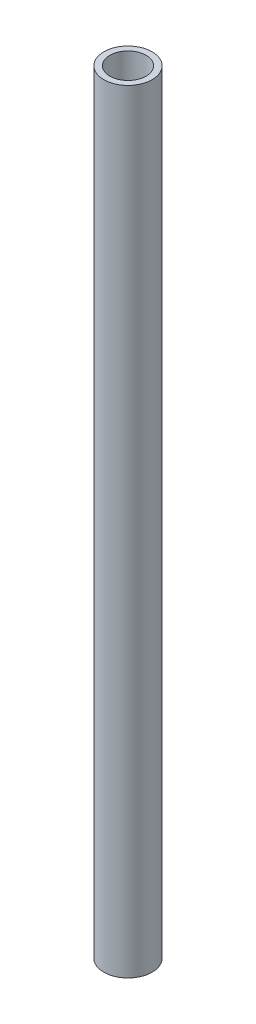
from build123d import *

# Parameters (mm, degrees)
SKETCH2_R      = 3.175
SKETCH2_R_2    = 2.38125
EXTRUDE1_DEPTH = 101.6


with BuildPart() as part:
    # Sketch2 → Extrude1 (new body)
    with BuildSketch(Plane(origin=(0, 0, 0), x_dir=(1, 0, 0), z_dir=(0, 1, 0))):
        with Locations(Location((0, 0, 0), (0, 0, 270))):
            Circle(SKETCH2_R)
        with Locations(Location((0, 0, 0), (0, 0, 270))):
            Circle(SKETCH2_R_2, mode=Mode.SUBTRACT)
    extrude(amount=EXTRUDE1_DEPTH)


solid = part.part
